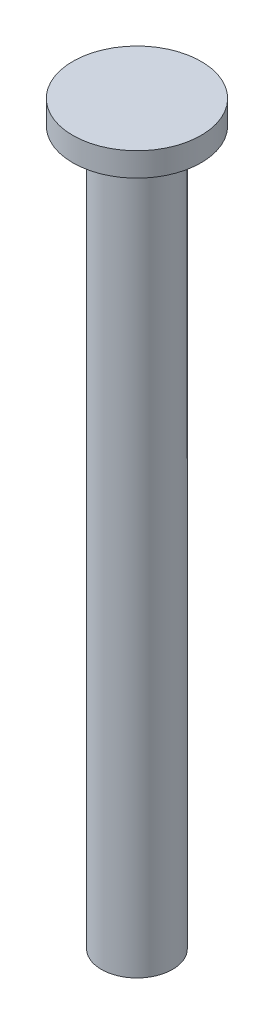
from build123d import *

# Parameters (mm, degrees)
IZIM2_R                     = 2.7
Y_KSEKLIK_EKSTR_ZYON1_DEPTH = 1
IZIM3_R                     = 1.5
Y_KSEKLIK_EKSTR_ZYON2_DEPTH = 30


with BuildPart() as part:
    # izim2 → Y_kseklik-Ekstr_zyon1 (new body)
    with BuildSketch(Plane(origin=(0, 0, 0), x_dir=(1, 0, 0), z_dir=(0, 1, 0))):
        with Locations(Location((0, 0, 0), (0, 0, 270))):
            Circle(IZIM2_R)
    extrude(amount=Y_KSEKLIK_EKSTR_ZYON1_DEPTH)

    # izim3 → Y_kseklik-Ekstr_zyon2 (add)
    with BuildSketch(Plane.XZ):
        with Locations(Location((0, 0, 0), (0, 0, 270))):
            Circle(IZIM3_R)
    extrude(amount=Y_KSEKLIK_EKSTR_ZYON2_DEPTH)


solid = part.part
